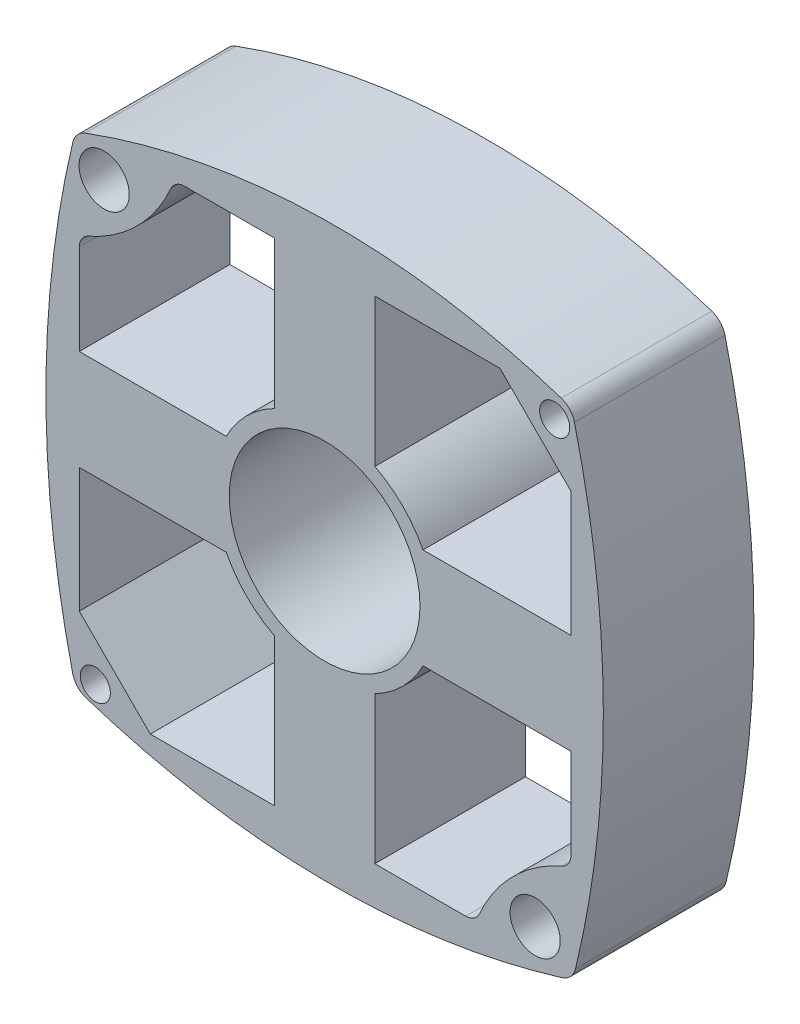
ISO-10303-21;
HEADER;
FILE_DESCRIPTION(('STEP AP214'),'2;1');
FILE_NAME('part.step','',(''),(''),'','','');
FILE_SCHEMA(('AUTOMOTIVE_DESIGN { 1 0 10303 214 1 1 1 1 }'));
ENDSEC;
DATA;
#1=APPLICATION_CONTEXT('core data for automotive mechanical design processes');
#2=APPLICATION_PROTOCOL_DEFINITION('international standard','automotive_design',2000,#1);
#3=PRODUCT_CONTEXT('',#1,'mechanical');
#4=PRODUCT('Part','Part','',(#3));
#5=PRODUCT_RELATED_PRODUCT_CATEGORY('part','',(#4));
#6=PRODUCT_DEFINITION_FORMATION('','',#4);
#7=PRODUCT_DEFINITION_CONTEXT('part definition',#1,'design');
#8=PRODUCT_DEFINITION('design','',#6,#7);
#9=PRODUCT_DEFINITION_SHAPE('','',#8);
#10=(LENGTH_UNIT() NAMED_UNIT(*) SI_UNIT(.MILLI.,.METRE.));
#11=(NAMED_UNIT(*) PLANE_ANGLE_UNIT() SI_UNIT($,.RADIAN.));
#12=(NAMED_UNIT(*) SI_UNIT($,.STERADIAN.) SOLID_ANGLE_UNIT());
#13=UNCERTAINTY_MEASURE_WITH_UNIT(LENGTH_MEASURE(1.E-05),#10,'distance_accuracy_value','');
#14=(GEOMETRIC_REPRESENTATION_CONTEXT(3) GLOBAL_UNCERTAINTY_ASSIGNED_CONTEXT((#13)) GLOBAL_UNIT_ASSIGNED_CONTEXT((#10,
#11,#12)) REPRESENTATION_CONTEXT('',''));
#15=CARTESIAN_POINT('',(0.,0.,0.));
#16=DIRECTION('',(0.,0.,1.));
#17=DIRECTION('',(1.,0.,0.));
#18=AXIS2_PLACEMENT_3D('',#15,#16,#17);
#19=CARTESIAN_POINT('',(24.5333983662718,17.4326752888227,15.));
#20=DIRECTION('',(-1.,0.,0.));
#21=DIRECTION('',(0.,-1.,0.));
#22=AXIS2_PLACEMENT_3D('',#19,#20,#21);
#23=PLANE('',#22);
#24=DIRECTION('',(0.,1.,0.));
#25=VECTOR('',#24,1.);
#26=CARTESIAN_POINT('',(24.5333983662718,17.4326752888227,15.));
#27=LINE('',#26,#25);
#28=CARTESIAN_POINT('',(24.5333983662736,-13.9776558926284,15.));
#29=VERTEX_POINT('',#28);
#30=CARTESIAN_POINT('',(24.5333983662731,-4.93740820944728,15.));
#31=VERTEX_POINT('',#30);
#32=EDGE_CURVE('E765',#29,#31,#27,.T.);
#33=ORIENTED_EDGE('',*,*,#32,.T.);
#34=DIRECTION('',(0.,0.,-1.));
#35=VECTOR('',#34,1.);
#36=CARTESIAN_POINT('',(24.5333983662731,-4.93740820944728,15.));
#37=LINE('',#36,#35);
#38=CARTESIAN_POINT('',(24.5333983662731,-4.93740820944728,0.));
#39=VERTEX_POINT('',#38);
#40=EDGE_CURVE('E11',#31,#39,#37,.T.);
#41=ORIENTED_EDGE('',*,*,#40,.T.);
#42=DIRECTION('',(0.,1.,0.));
#43=VECTOR('',#42,1.);
#44=CARTESIAN_POINT('',(24.5333983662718,17.4326752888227,0.));
#45=LINE('',#44,#43);
#46=CARTESIAN_POINT('',(24.5333983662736,-13.9776558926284,0.));
#47=VERTEX_POINT('',#46);
#48=EDGE_CURVE('E738',#47,#39,#45,.T.);
#49=ORIENTED_EDGE('',*,*,#48,.F.);
#50=DIRECTION('',(0.,0.,1.));
#51=VECTOR('',#50,1.);
#52=CARTESIAN_POINT('',(24.5333983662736,-13.9776558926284,15.));
#53=LINE('',#52,#51);
#54=EDGE_CURVE('E879',#47,#29,#53,.T.);
#55=ORIENTED_EDGE('',*,*,#54,.T.);
#56=EDGE_LOOP('',(#33,#41,#49,#55));
#57=FACE_BOUND('',#56,.T.);
#58=ADVANCED_FACE('F348',(#57),#23,.T.);
#59=CARTESIAN_POINT('',(24.5333983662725,4.93740820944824,0.));
#60=VERTEX_POINT('',#59);
#61=CARTESIAN_POINT('',(24.5333983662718,17.4326752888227,0.));
#62=VERTEX_POINT('',#61);
#63=EDGE_CURVE('E737',#60,#62,#45,.T.);
#64=ORIENTED_EDGE('',*,*,#63,.F.);
#65=DIRECTION('',(0.,0.,-1.));
#66=VECTOR('',#65,1.);
#67=CARTESIAN_POINT('',(24.5333983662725,4.93740820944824,15.));
#68=LINE('',#67,#66);
#69=CARTESIAN_POINT('',(24.5333983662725,4.93740820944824,15.));
#70=VERTEX_POINT('',#69);
#71=EDGE_CURVE('E356',#60,#70,#68,.F.);
#72=ORIENTED_EDGE('',*,*,#71,.T.);
#73=CARTESIAN_POINT('',(24.5333983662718,17.4326752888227,15.));
#74=VERTEX_POINT('',#73);
#75=EDGE_CURVE('E764',#70,#74,#27,.T.);
#76=ORIENTED_EDGE('',*,*,#75,.T.);
#77=DIRECTION('',(0.,0.,-1.));
#78=VECTOR('',#77,1.);
#79=CARTESIAN_POINT('',(24.5333983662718,17.4326752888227,15.));
#80=LINE('',#79,#78);
#81=EDGE_CURVE('E786',#74,#62,#80,.T.);
#82=ORIENTED_EDGE('',*,*,#81,.T.);
#83=EDGE_LOOP('',(#64,#72,#76,#82));
#84=FACE_BOUND('',#83,.T.);
#85=ADVANCED_FACE('F897',(#84),#23,.T.);
#86=CARTESIAN_POINT('',(-24.436295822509,15.0298698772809,15.));
#87=DIRECTION('',(1.,0.,0.));
#88=DIRECTION('',(0.,1.,0.));
#89=AXIS2_PLACEMENT_3D('',#86,#87,#88);
#90=PLANE('',#89);
#91=DIRECTION('',(0.,-1.,0.));
#92=VECTOR('',#91,1.);
#93=CARTESIAN_POINT('',(-24.436295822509,15.0298698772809,15.));
#94=LINE('',#93,#92);
#95=CARTESIAN_POINT('',(-24.4362958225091,14.0186709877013,15.));
#96=VERTEX_POINT('',#95);
#97=CARTESIAN_POINT('',(-24.4362958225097,5.00000000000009,15.));
#98=VERTEX_POINT('',#97);
#99=EDGE_CURVE('E778',#96,#98,#94,.T.);
#100=ORIENTED_EDGE('',*,*,#99,.T.);
#101=DIRECTION('',(0.,0.,-1.));
#102=VECTOR('',#101,1.);
#103=CARTESIAN_POINT('',(-24.4362958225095,5.00000000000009,15.));
#104=LINE('',#103,#102);
#105=CARTESIAN_POINT('',(-24.4362958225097,5.00000000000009,0.));
#106=VERTEX_POINT('',#105);
#107=EDGE_CURVE('E652',#98,#106,#104,.T.);
#108=ORIENTED_EDGE('',*,*,#107,.T.);
#109=DIRECTION('',(0.,-1.,0.));
#110=VECTOR('',#109,1.);
#111=CARTESIAN_POINT('',(-24.436295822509,15.0298698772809,0.));
#112=LINE('',#111,#110);
#113=CARTESIAN_POINT('',(-24.4362958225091,14.0186709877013,0.));
#114=VERTEX_POINT('',#113);
#115=EDGE_CURVE('E752',#114,#106,#112,.T.);
#116=ORIENTED_EDGE('',*,*,#115,.F.);
#117=DIRECTION('',(0.,0.,1.));
#118=VECTOR('',#117,1.);
#119=CARTESIAN_POINT('',(-24.4362958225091,14.0186709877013,15.));
#120=LINE('',#119,#118);
#121=EDGE_CURVE('E857',#114,#96,#120,.T.);
#122=ORIENTED_EDGE('',*,*,#121,.T.);
#123=EDGE_LOOP('',(#100,#108,#116,#122));
#124=FACE_BOUND('',#123,.T.);
#125=ADVANCED_FACE('F939',(#124),#90,.T.);
#126=CARTESIAN_POINT('',(-24.43629582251,-4.99999999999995,0.));
#127=VERTEX_POINT('',#126);
#128=CARTESIAN_POINT('',(-24.4362958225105,-17.3999490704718,0.));
#129=VERTEX_POINT('',#128);
#130=EDGE_CURVE('E751',#127,#129,#112,.T.);
#131=ORIENTED_EDGE('',*,*,#130,.F.);
#132=DIRECTION('',(0.,0.,1.));
#133=VECTOR('',#132,1.);
#134=CARTESIAN_POINT('',(-24.43629582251,-4.99999999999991,15.));
#135=LINE('',#134,#133);
#136=CARTESIAN_POINT('',(-24.4362958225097,-4.99999999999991,15.));
#137=VERTEX_POINT('',#136);
#138=EDGE_CURVE('E607',#127,#137,#135,.T.);
#139=ORIENTED_EDGE('',*,*,#138,.T.);
#140=CARTESIAN_POINT('',(-24.4362958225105,-17.3999490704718,15.));
#141=VERTEX_POINT('',#140);
#142=EDGE_CURVE('E777',#137,#141,#94,.T.);
#143=ORIENTED_EDGE('',*,*,#142,.T.);
#144=DIRECTION('',(0.,0.,-1.));
#145=VECTOR('',#144,1.);
#146=CARTESIAN_POINT('',(-24.4362958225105,-17.3999490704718,15.));
#147=LINE('',#146,#145);
#148=EDGE_CURVE('E781',#141,#129,#147,.T.);
#149=ORIENTED_EDGE('',*,*,#148,.T.);
#150=EDGE_LOOP('',(#131,#139,#143,#149));
#151=FACE_BOUND('',#150,.T.);
#152=ADVANCED_FACE('F1068',(#151),#90,.T.);
#153=CARTESIAN_POINT('',(0.,0.,15.));
#154=DIRECTION('',(0.,0.,-1.));
#155=DIRECTION('',(-1.,0.,0.));
#156=AXIS2_PLACEMENT_3D('',#153,#154,#155);
#157=CYLINDRICAL_SURFACE('',#156,11.);
#158=DIRECTION('',(0.,0.,-1.));
#159=VECTOR('',#158,1.);
#160=CARTESIAN_POINT('',(-9.79795897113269,5.00000000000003,15.));
#161=LINE('',#160,#159);
#162=CARTESIAN_POINT('',(-9.79795897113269,5.00000000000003,15.));
#163=VERTEX_POINT('',#162);
#164=CARTESIAN_POINT('',(-9.79795897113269,5.00000000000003,0.));
#165=VERTEX_POINT('',#164);
#166=EDGE_CURVE('E646',#163,#165,#161,.T.);
#167=ORIENTED_EDGE('',*,*,#166,.F.);
#168=CARTESIAN_POINT('',(0.,0.,15.));
#169=DIRECTION('',(0.,0.,1.));
#170=DIRECTION('',(1.,0.,0.));
#171=AXIS2_PLACEMENT_3D('',#168,#169,#170);
#172=CIRCLE('',#171,11.);
#173=CARTESIAN_POINT('',(-5.,9.79795897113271,15.));
#174=VERTEX_POINT('',#173);
#175=EDGE_CURVE('E671',#174,#163,#172,.T.);
#176=ORIENTED_EDGE('',*,*,#175,.F.);
#177=DIRECTION('',(0.,0.,-1.));
#178=VECTOR('',#177,1.);
#179=CARTESIAN_POINT('',(-5.,9.79795897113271,15.));
#180=LINE('',#179,#178);
#181=CARTESIAN_POINT('',(-5.,9.79795897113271,0.));
#182=VERTEX_POINT('',#181);
#183=EDGE_CURVE('E697',#174,#182,#180,.T.);
#184=ORIENTED_EDGE('',*,*,#183,.T.);
#185=CARTESIAN_POINT('',(0.,0.,0.));
#186=DIRECTION('',(0.,0.,1.));
#187=DIRECTION('',(1.,0.,0.));
#188=AXIS2_PLACEMENT_3D('',#185,#186,#187);
#189=CIRCLE('',#188,11.);
#190=EDGE_CURVE('E658',#182,#165,#189,.T.);
#191=ORIENTED_EDGE('',*,*,#190,.T.);
#192=EDGE_LOOP('',(#167,#176,#184,#191));
#193=FACE_BOUND('',#192,.T.);
#194=ADVANCED_FACE('F928',(#193),#157,.T.);
#195=DIRECTION('',(0.,0.,-1.));
#196=VECTOR('',#195,1.);
#197=CARTESIAN_POINT('',(-9.79795897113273,-4.99999999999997,15.));
#198=LINE('',#197,#196);
#199=CARTESIAN_POINT('',(-9.79795897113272,-4.99999999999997,15.));
#200=VERTEX_POINT('',#199);
#201=CARTESIAN_POINT('',(-9.79795897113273,-4.99999999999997,0.));
#202=VERTEX_POINT('',#201);
#203=EDGE_CURVE('E643',#200,#202,#198,.T.);
#204=ORIENTED_EDGE('',*,*,#203,.T.);
#205=CARTESIAN_POINT('',(-5.,-9.79795897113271,0.));
#206=VERTEX_POINT('',#205);
#207=EDGE_CURVE('E657',#202,#206,#189,.T.);
#208=ORIENTED_EDGE('',*,*,#207,.T.);
#209=DIRECTION('',(0.,0.,-1.));
#210=VECTOR('',#209,1.);
#211=CARTESIAN_POINT('',(-5.,-9.79795897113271,15.));
#212=LINE('',#211,#210);
#213=CARTESIAN_POINT('',(-5.,-9.79795897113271,15.));
#214=VERTEX_POINT('',#213);
#215=EDGE_CURVE('E694',#214,#206,#212,.T.);
#216=ORIENTED_EDGE('',*,*,#215,.F.);
#217=EDGE_CURVE('E670',#200,#214,#172,.T.);
#218=ORIENTED_EDGE('',*,*,#217,.F.);
#219=EDGE_LOOP('',(#204,#208,#216,#218));
#220=FACE_BOUND('',#219,.T.);
#221=ADVANCED_FACE('F920',(#220),#157,.T.);
#222=CARTESIAN_POINT('',(0.,0.,15.));
#223=DIRECTION('',(0.,0.,-1.));
#224=DIRECTION('',(-1.,0.,0.));
#225=AXIS2_PLACEMENT_3D('',#222,#223,#224);
#226=CYLINDRICAL_SURFACE('',#225,11.);
#227=DIRECTION('',(0.,0.,-1.));
#228=VECTOR('',#227,1.);
#229=CARTESIAN_POINT('',(9.79795897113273,4.99999999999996,15.));
#230=LINE('',#229,#228);
#231=CARTESIAN_POINT('',(9.79795897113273,4.99999999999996,15.));
#232=VERTEX_POINT('',#231);
#233=CARTESIAN_POINT('',(9.79795897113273,4.99999999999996,0.));
#234=VERTEX_POINT('',#233);
#235=EDGE_CURVE('E608',#232,#234,#230,.T.);
#236=ORIENTED_EDGE('',*,*,#235,.T.);
#237=CARTESIAN_POINT('',(0.,0.,0.));
#238=DIRECTION('',(0.,0.,1.));
#239=DIRECTION('',(1.,0.,0.));
#240=AXIS2_PLACEMENT_3D('',#237,#238,#239);
#241=CIRCLE('',#240,11.);
#242=CARTESIAN_POINT('',(5.,9.79795897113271,0.));
#243=VERTEX_POINT('',#242);
#244=EDGE_CURVE('E613',#234,#243,#241,.T.);
#245=ORIENTED_EDGE('',*,*,#244,.T.);
#246=DIRECTION('',(0.,0.,-1.));
#247=VECTOR('',#246,1.);
#248=CARTESIAN_POINT('',(5.,9.79795897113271,15.));
#249=LINE('',#248,#247);
#250=CARTESIAN_POINT('',(5.,9.79795897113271,15.));
#251=VERTEX_POINT('',#250);
#252=EDGE_CURVE('E688',#251,#243,#249,.T.);
#253=ORIENTED_EDGE('',*,*,#252,.F.);
#254=CARTESIAN_POINT('',(0.,0.,15.));
#255=DIRECTION('',(0.,0.,1.));
#256=DIRECTION('',(1.,0.,0.));
#257=AXIS2_PLACEMENT_3D('',#254,#255,#256);
#258=CIRCLE('',#257,11.);
#259=EDGE_CURVE('E679',#232,#251,#258,.T.);
#260=ORIENTED_EDGE('',*,*,#259,.F.);
#261=EDGE_LOOP('',(#236,#245,#253,#260));
#262=FACE_BOUND('',#261,.T.);
#263=ADVANCED_FACE('F917',(#262),#226,.T.);
#264=DIRECTION('',(0.,0.,-1.));
#265=VECTOR('',#264,1.);
#266=CARTESIAN_POINT('',(9.7979589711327,-5.00000000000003,15.));
#267=LINE('',#266,#265);
#268=CARTESIAN_POINT('',(9.79795897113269,-5.00000000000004,15.));
#269=VERTEX_POINT('',#268);
#270=CARTESIAN_POINT('',(9.79795897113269,-5.00000000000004,0.));
#271=VERTEX_POINT('',#270);
#272=EDGE_CURVE('E640',#269,#271,#267,.T.);
#273=ORIENTED_EDGE('',*,*,#272,.F.);
#274=CARTESIAN_POINT('',(5.00000000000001,-9.79795897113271,15.));
#275=VERTEX_POINT('',#274);
#276=EDGE_CURVE('E680',#275,#269,#258,.T.);
#277=ORIENTED_EDGE('',*,*,#276,.F.);
#278=DIRECTION('',(0.,0.,-1.));
#279=VECTOR('',#278,1.);
#280=CARTESIAN_POINT('',(5.00000000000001,-9.79795897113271,15.));
#281=LINE('',#280,#279);
#282=CARTESIAN_POINT('',(5.00000000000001,-9.79795897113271,0.));
#283=VERTEX_POINT('',#282);
#284=EDGE_CURVE('E691',#275,#283,#281,.T.);
#285=ORIENTED_EDGE('',*,*,#284,.T.);
#286=EDGE_CURVE('E664',#283,#271,#241,.T.);
#287=ORIENTED_EDGE('',*,*,#286,.T.);
#288=EDGE_LOOP('',(#273,#277,#285,#287));
#289=FACE_BOUND('',#288,.T.);
#290=ADVANCED_FACE('F919',(#289),#226,.T.);
#291=CARTESIAN_POINT('',(-17.3677609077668,-24.468483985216,15.));
#292=DIRECTION('',(0.,1.,0.));
#293=DIRECTION('',(-1.,0.,0.));
#294=AXIS2_PLACEMENT_3D('',#291,#292,#293);
#295=PLANE('',#294);
#296=DIRECTION('',(1.,0.,0.));
#297=VECTOR('',#296,1.);
#298=CARTESIAN_POINT('',(-17.3677609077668,-24.468483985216,15.));
#299=LINE('',#298,#297);
#300=CARTESIAN_POINT('',(-17.3677609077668,-24.468483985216,15.));
#301=VERTEX_POINT('',#300);
#302=CARTESIAN_POINT('',(-5.,-24.4684839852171,15.));
#303=VERTEX_POINT('',#302);
#304=EDGE_CURVE('E758',#301,#303,#299,.T.);
#305=ORIENTED_EDGE('',*,*,#304,.T.);
#306=DIRECTION('',(0.,0.,-1.));
#307=VECTOR('',#306,1.);
#308=CARTESIAN_POINT('',(-5.,-24.4684839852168,15.));
#309=LINE('',#308,#307);
#310=CARTESIAN_POINT('',(-5.,-24.4684839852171,0.));
#311=VERTEX_POINT('',#310);
#312=EDGE_CURVE('E893',#303,#311,#309,.T.);
#313=ORIENTED_EDGE('',*,*,#312,.T.);
#314=DIRECTION('',(1.,0.,0.));
#315=VECTOR('',#314,1.);
#316=CARTESIAN_POINT('',(-17.3677609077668,-24.468483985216,0.));
#317=LINE('',#316,#315);
#318=CARTESIAN_POINT('',(-17.3677609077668,-24.468483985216,0.));
#319=VERTEX_POINT('',#318);
#320=EDGE_CURVE('E731',#319,#311,#317,.T.);
#321=ORIENTED_EDGE('',*,*,#320,.F.);
#322=DIRECTION('',(0.,0.,-1.));
#323=VECTOR('',#322,1.);
#324=CARTESIAN_POINT('',(-17.3677609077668,-24.468483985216,15.));
#325=LINE('',#324,#323);
#326=EDGE_CURVE('E789',#301,#319,#325,.T.);
#327=ORIENTED_EDGE('',*,*,#326,.F.);
#328=EDGE_LOOP('',(#305,#313,#321,#327));
#329=FACE_BOUND('',#328,.T.);
#330=ADVANCED_FACE('F926',(#329),#295,.T.);
#331=CARTESIAN_POINT('',(5.,-24.4684839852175,0.));
#332=VERTEX_POINT('',#331);
#333=CARTESIAN_POINT('',(14.0508591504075,-24.4684839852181,0.));
#334=VERTEX_POINT('',#333);
#335=EDGE_CURVE('E730',#332,#334,#317,.T.);
#336=ORIENTED_EDGE('',*,*,#335,.F.);
#337=DIRECTION('',(0.,0.,1.));
#338=VECTOR('',#337,1.);
#339=CARTESIAN_POINT('',(5.,-24.4684839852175,15.));
#340=LINE('',#339,#338);
#341=CARTESIAN_POINT('',(5.,-24.4684839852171,15.));
#342=VERTEX_POINT('',#341);
#343=EDGE_CURVE('E890',#332,#342,#340,.T.);
#344=ORIENTED_EDGE('',*,*,#343,.T.);
#345=CARTESIAN_POINT('',(14.0508591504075,-24.4684839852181,15.));
#346=VERTEX_POINT('',#345);
#347=EDGE_CURVE('E757',#342,#346,#299,.T.);
#348=ORIENTED_EDGE('',*,*,#347,.T.);
#349=DIRECTION('',(0.,0.,1.));
#350=VECTOR('',#349,1.);
#351=CARTESIAN_POINT('',(14.0508591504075,-24.4684839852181,0.));
#352=LINE('',#351,#350);
#353=EDGE_CURVE('E871',#346,#334,#352,.F.);
#354=ORIENTED_EDGE('',*,*,#353,.T.);
#355=EDGE_LOOP('',(#336,#344,#348,#354));
#356=FACE_BOUND('',#355,.T.);
#357=ADVANCED_FACE('F950',(#356),#295,.T.);
#358=CARTESIAN_POINT('',(-14.9556277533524,24.5012102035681,15.));
#359=DIRECTION('',(0.,-1.,0.));
#360=DIRECTION('',(1.,0.,0.));
#361=AXIS2_PLACEMENT_3D('',#358,#359,#360);
#362=PLANE('',#361);
#363=DIRECTION('',(-1.,0.,0.));
#364=VECTOR('',#363,1.);
#365=CARTESIAN_POINT('',(-14.9556277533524,24.5012102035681,0.));
#366=LINE('',#365,#364);
#367=CARTESIAN_POINT('',(-4.99999999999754,24.5012102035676,0.));
#368=VERTEX_POINT('',#367);
#369=CARTESIAN_POINT('',(-13.94546772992,24.5012102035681,0.));
#370=VERTEX_POINT('',#369);
#371=EDGE_CURVE('E744',#368,#370,#366,.T.);
#372=ORIENTED_EDGE('',*,*,#371,.F.);
#373=DIRECTION('',(0.,0.,-1.));
#374=VECTOR('',#373,1.);
#375=CARTESIAN_POINT('',(-5.,24.5012102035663,15.));
#376=LINE('',#375,#374);
#377=CARTESIAN_POINT('',(-5.,24.5012102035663,15.));
#378=VERTEX_POINT('',#377);
#379=EDGE_CURVE('E700',#378,#368,#376,.T.);
#380=ORIENTED_EDGE('',*,*,#379,.F.);
#381=DIRECTION('',(-1.,0.,0.));
#382=VECTOR('',#381,1.);
#383=CARTESIAN_POINT('',(-14.9556277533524,24.5012102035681,15.));
#384=LINE('',#383,#382);
#385=CARTESIAN_POINT('',(-13.94546772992,24.5012102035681,15.));
#386=VERTEX_POINT('',#385);
#387=EDGE_CURVE('E770',#378,#386,#384,.T.);
#388=ORIENTED_EDGE('',*,*,#387,.T.);
#389=DIRECTION('',(0.,0.,1.));
#390=VECTOR('',#389,1.);
#391=CARTESIAN_POINT('',(-13.94546772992,24.5012102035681,0.));
#392=LINE('',#391,#390);
#393=EDGE_CURVE('E859',#386,#370,#392,.F.);
#394=ORIENTED_EDGE('',*,*,#393,.T.);
#395=EDGE_LOOP('',(#372,#380,#388,#394));
#396=FACE_BOUND('',#395,.T.);
#397=ADVANCED_FACE('F1072',(#396),#362,.T.);
#398=CARTESIAN_POINT('',(17.4648634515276,24.5012102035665,15.));
#399=VERTEX_POINT('',#398);
#400=CARTESIAN_POINT('',(5.,24.5012102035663,15.));
#401=VERTEX_POINT('',#400);
#402=EDGE_CURVE('E771',#399,#401,#384,.T.);
#403=ORIENTED_EDGE('',*,*,#402,.T.);
#404=DIRECTION('',(0.,0.,-1.));
#405=VECTOR('',#404,1.);
#406=CARTESIAN_POINT('',(5.,24.5012102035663,15.));
#407=LINE('',#406,#405);
#408=CARTESIAN_POINT('',(5.,24.5012102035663,0.));
#409=VERTEX_POINT('',#408);
#410=EDGE_CURVE('E685',#401,#409,#407,.T.);
#411=ORIENTED_EDGE('',*,*,#410,.T.);
#412=CARTESIAN_POINT('',(17.4648634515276,24.5012102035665,0.));
#413=VERTEX_POINT('',#412);
#414=EDGE_CURVE('E745',#413,#409,#366,.T.);
#415=ORIENTED_EDGE('',*,*,#414,.F.);
#416=DIRECTION('',(0.,0.,-1.));
#417=VECTOR('',#416,1.);
#418=CARTESIAN_POINT('',(17.4648634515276,24.5012102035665,15.));
#419=LINE('',#418,#417);
#420=EDGE_CURVE('E784',#399,#413,#419,.T.);
#421=ORIENTED_EDGE('',*,*,#420,.F.);
#422=EDGE_LOOP('',(#403,#411,#415,#421));
#423=FACE_BOUND('',#422,.T.);
#424=ADVANCED_FACE('F910',(#423),#362,.T.);
#425=CARTESIAN_POINT('',(36.4242579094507,-21.7661300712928,15.));
#426=DIRECTION('',(0.,0.,-1.));
#427=DIRECTION('',(-1.,0.,0.));
#428=AXIS2_PLACEMENT_3D('',#425,#426,#427);
#429=PLANE('',#428);
#430=CARTESIAN_POINT('',(0.,0.,15.));
#431=DIRECTION('',(0.,0.,1.));
#432=DIRECTION('',(1.,0.,0.));
#433=AXIS2_PLACEMENT_3D('',#430,#431,#432);
#434=CIRCLE('',#433,9.5);
#435=CARTESIAN_POINT('',(9.5,0.,15.));
#436=VERTEX_POINT('',#435);
#437=EDGE_CURVE('E1147',#436,#436,#434,.T.);
#438=ORIENTED_EDGE('',*,*,#437,.F.);
#439=EDGE_LOOP('',(#438));
#440=FACE_BOUND('',#439,.T.);
#441=ORIENTED_EDGE('',*,*,#75,.F.);
#442=CARTESIAN_POINT('',(15.0076892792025,0.0783337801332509,15.));
#443=DIRECTION('',(0.,0.,1.));
#444=DIRECTION('',(0.,1.,0.));
#445=AXIS2_PLACEMENT_3D('',#442,#443,#444);
#446=CIRCLE('',#445,10.6934436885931);
#447=CARTESIAN_POINT('',(24.5012102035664,4.99999999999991,15.));
#448=VERTEX_POINT('',#447);
#449=EDGE_CURVE('E626',#70,#448,#446,.T.);
#450=ORIENTED_EDGE('',*,*,#449,.T.);
#451=DIRECTION('',(-1.,0.,0.));
#452=VECTOR('',#451,1.);
#453=CARTESIAN_POINT('',(24.5012102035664,4.99999999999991,15.));
#454=LINE('',#453,#452);
#455=EDGE_CURVE('E606',#448,#232,#454,.T.);
#456=ORIENTED_EDGE('',*,*,#455,.T.);
#457=ORIENTED_EDGE('',*,*,#259,.T.);
#458=DIRECTION('',(0.,1.,0.));
#459=VECTOR('',#458,1.);
#460=CARTESIAN_POINT('',(5.,24.5012102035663,15.));
#461=LINE('',#460,#459);
#462=EDGE_CURVE('E683',#251,#401,#461,.T.);
#463=ORIENTED_EDGE('',*,*,#462,.T.);
#464=ORIENTED_EDGE('',*,*,#402,.F.);
#465=DIRECTION('',(-0.707106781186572,0.707106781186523,0.));
#466=VECTOR('',#465,1.);
#467=CARTESIAN_POINT('',(17.4648634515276,24.5012102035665,15.));
#468=LINE('',#467,#466);
#469=EDGE_CURVE('E768',#74,#399,#468,.T.);
#470=ORIENTED_EDGE('',*,*,#469,.F.);
#471=EDGE_LOOP('',(#441,#450,#456,#457,#463,#464,#470));
#472=FACE_BOUND('',#471,.T.);
#473=DIRECTION('',(0.,-1.,0.));
#474=VECTOR('',#473,1.);
#475=CARTESIAN_POINT('',(-5.,24.5012102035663,15.));
#476=LINE('',#475,#474);
#477=EDGE_CURVE('E668',#378,#174,#476,.T.);
#478=ORIENTED_EDGE('',*,*,#477,.T.);
#479=ORIENTED_EDGE('',*,*,#175,.T.);
#480=DIRECTION('',(-1.,0.,0.));
#481=VECTOR('',#480,1.);
#482=CARTESIAN_POINT('',(-24.5012102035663,5.00000000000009,15.));
#483=LINE('',#482,#481);
#484=EDGE_CURVE('E629',#163,#98,#483,.T.);
#485=ORIENTED_EDGE('',*,*,#484,.T.);
#486=ORIENTED_EDGE('',*,*,#99,.F.);
#487=CARTESIAN_POINT('',(-22.9362958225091,14.0186709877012,15.));
#488=DIRECTION('',(0.,0.,-1.));
#489=DIRECTION('',(-1.,0.,0.));
#490=AXIS2_PLACEMENT_3D('',#487,#488,#489);
#491=CIRCLE('',#490,1.5);
#492=CARTESIAN_POINT('',(-23.5396822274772,15.3919607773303,15.));
#493=VERTEX_POINT('',#492);
#494=EDGE_CURVE('E864',#96,#493,#491,.T.);
#495=ORIENTED_EDGE('',*,*,#494,.T.);
#496=CARTESIAN_POINT('',(-29.9876635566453,30.0673774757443,15.));
#497=DIRECTION('',(0.,0.,-1.));
#498=DIRECTION('',(-1.,0.,0.));
#499=AXIS2_PLACEMENT_3D('',#496,#497,#498);
#500=CIRCLE('',#499,16.0294827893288);
#501=CARTESIAN_POINT('',(-15.3182004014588,23.605863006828,15.));
#502=VERTEX_POINT('',#501);
#503=EDGE_CURVE('E774',#502,#493,#500,.T.);
#504=ORIENTED_EDGE('',*,*,#503,.F.);
#505=CARTESIAN_POINT('',(-13.9454677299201,23.0012102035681,15.));
#506=DIRECTION('',(0.,0.,-1.));
#507=DIRECTION('',(-1.,0.,0.));
#508=AXIS2_PLACEMENT_3D('',#505,#506,#507);
#509=CIRCLE('',#508,1.5);
#510=EDGE_CURVE('E868',#502,#386,#509,.T.);
#511=ORIENTED_EDGE('',*,*,#510,.T.);
#512=ORIENTED_EDGE('',*,*,#387,.F.);
#513=EDGE_LOOP('',(#478,#479,#485,#486,#495,#504,#511,#512));
#514=FACE_BOUND('',#513,.T.);
#515=ORIENTED_EDGE('',*,*,#142,.F.);
#516=DIRECTION('',(1.,0.,0.));
#517=VECTOR('',#516,1.);
#518=CARTESIAN_POINT('',(-24.5012102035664,-4.99999999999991,15.));
#519=LINE('',#518,#517);
#520=EDGE_CURVE('E632',#137,#200,#519,.T.);
#521=ORIENTED_EDGE('',*,*,#520,.T.);
#522=ORIENTED_EDGE('',*,*,#217,.T.);
#523=DIRECTION('',(0.,-1.,0.));
#524=VECTOR('',#523,1.);
#525=CARTESIAN_POINT('',(-5.,-24.5012102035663,15.));
#526=LINE('',#525,#524);
#527=EDGE_CURVE('E674',#214,#303,#526,.T.);
#528=ORIENTED_EDGE('',*,*,#527,.T.);
#529=ORIENTED_EDGE('',*,*,#304,.F.);
#530=DIRECTION('',(0.707106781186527,-0.707106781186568,0.));
#531=VECTOR('',#530,1.);
#532=CARTESIAN_POINT('',(-24.4362958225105,-17.3999490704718,15.));
#533=LINE('',#532,#531);
#534=EDGE_CURVE('E755',#141,#301,#533,.T.);
#535=ORIENTED_EDGE('',*,*,#534,.F.);
#536=EDGE_LOOP('',(#515,#521,#522,#528,#529,#535));
#537=FACE_BOUND('',#536,.T.);
#538=CARTESIAN_POINT('',(15.0076892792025,-0.0783337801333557,15.));
#539=DIRECTION('',(0.,0.,1.));
#540=DIRECTION('',(0.,-1.,0.));
#541=AXIS2_PLACEMENT_3D('',#538,#539,#540);
#542=CIRCLE('',#541,10.6934436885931);
#543=CARTESIAN_POINT('',(24.5012102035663,-5.00000000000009,15.));
#544=VERTEX_POINT('',#543);
#545=EDGE_CURVE('E623',#544,#31,#542,.T.);
#546=ORIENTED_EDGE('',*,*,#545,.T.);
#547=ORIENTED_EDGE('',*,*,#32,.F.);
#548=CARTESIAN_POINT('',(23.0333983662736,-13.9776558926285,15.));
#549=DIRECTION('',(0.,0.,-1.));
#550=DIRECTION('',(-1.,0.,0.));
#551=AXIS2_PLACEMENT_3D('',#548,#549,#550);
#552=CIRCLE('',#551,1.5);
#553=CARTESIAN_POINT('',(23.6380511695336,-15.3503885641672,15.));
#554=VERTEX_POINT('',#553);
#555=EDGE_CURVE('E888',#29,#554,#552,.T.);
#556=ORIENTED_EDGE('',*,*,#555,.T.);
#557=CARTESIAN_POINT('',(30.0995656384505,-30.0198517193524,15.));
#558=DIRECTION('',(0.,0.,-1.));
#559=DIRECTION('',(1.,0.,0.));
#560=AXIS2_PLACEMENT_3D('',#557,#558,#559);
#561=CIRCLE('',#560,16.0294827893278);
#562=CARTESIAN_POINT('',(15.4241489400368,-23.5718703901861,15.));
#563=VERTEX_POINT('',#562);
#564=EDGE_CURVE('E761',#563,#554,#561,.T.);
#565=ORIENTED_EDGE('',*,*,#564,.F.);
#566=CARTESIAN_POINT('',(14.0508591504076,-22.9684839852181,15.));
#567=DIRECTION('',(0.,0.,-1.));
#568=DIRECTION('',(-1.,0.,0.));
#569=AXIS2_PLACEMENT_3D('',#566,#567,#568);
#570=CIRCLE('',#569,1.5);
#571=EDGE_CURVE('E883',#563,#346,#570,.T.);
#572=ORIENTED_EDGE('',*,*,#571,.T.);
#573=ORIENTED_EDGE('',*,*,#347,.F.);
#574=DIRECTION('',(0.,1.,0.));
#575=VECTOR('',#574,1.);
#576=CARTESIAN_POINT('',(5.,-24.5012102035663,15.));
#577=LINE('',#576,#575);
#578=EDGE_CURVE('E677',#342,#275,#577,.T.);
#579=ORIENTED_EDGE('',*,*,#578,.T.);
#580=ORIENTED_EDGE('',*,*,#276,.T.);
#581=DIRECTION('',(1.,0.,0.));
#582=VECTOR('',#581,1.);
#583=CARTESIAN_POINT('',(24.5012102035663,-5.00000000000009,15.));
#584=LINE('',#583,#582);
#585=EDGE_CURVE('E635',#269,#544,#584,.T.);
#586=ORIENTED_EDGE('',*,*,#585,.T.);
#587=EDGE_LOOP('',(#546,#547,#556,#565,#572,#573,#579,#580,#586));
#588=FACE_BOUND('',#587,.T.);
#589=CARTESIAN_POINT('',(1.06898181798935,-43.317450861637,15.));
#590=DIRECTION('',(0.,0.,1.));
#591=DIRECTION('',(1.,0.,0.));
#592=AXIS2_PLACEMENT_3D('',#589,#590,#591);
#593=CIRCLE('',#592,71.9064972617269);
#594=CARTESIAN_POINT('',(23.5660183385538,24.9791646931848,15.));
#595=VERTEX_POINT('',#594);
#596=CARTESIAN_POINT('',(-23.8295613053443,24.1407354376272,15.));
#597=VERTEX_POINT('',#596);
#598=EDGE_CURVE('E811',#595,#597,#593,.T.);
#599=ORIENTED_EDGE('',*,*,#598,.T.);
#600=CARTESIAN_POINT('',(-23.1370357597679,22.2644603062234,15.));
#601=DIRECTION('',(0.,0.,-1.));
#602=DIRECTION('',(-1.,0.,0.));
#603=AXIS2_PLACEMENT_3D('',#600,#601,#602);
#604=CIRCLE('',#603,2.);
#605=CARTESIAN_POINT('',(-25.0832007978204,22.7253742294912,15.));
#606=VERTEX_POINT('',#605);
#607=EDGE_CURVE('E842',#597,#606,#604,.F.);
#608=ORIENTED_EDGE('',*,*,#607,.T.);
#609=CARTESIAN_POINT('',(71.7795340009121,-0.21480928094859,15.));
#610=DIRECTION('',(0.,0.,1.));
#611=DIRECTION('',(-1.,0.,0.));
#612=AXIS2_PLACEMENT_3D('',#609,#610,#611);
#613=CIRCLE('',#612,99.5421589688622);
#614=CARTESIAN_POINT('',(-25.0947533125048,-23.1061585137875,15.));
#615=VERTEX_POINT('',#614);
#616=EDGE_CURVE('E803',#606,#615,#613,.T.);
#617=ORIENTED_EDGE('',*,*,#616,.T.);
#618=CARTESIAN_POINT('',(-23.14835616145,-22.6462257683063,15.));
#619=DIRECTION('',(0.,0.,-1.));
#620=DIRECTION('',(-1.,0.,0.));
#621=AXIS2_PLACEMENT_3D('',#618,#619,#620);
#622=CIRCLE('',#621,2.);
#623=CARTESIAN_POINT('',(-23.7693524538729,-24.5473737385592,15.));
#624=VERTEX_POINT('',#623);
#625=EDGE_CURVE('E838',#615,#624,#622,.F.);
#626=ORIENTED_EDGE('',*,*,#625,.T.);
#627=CARTESIAN_POINT('',(0.61921748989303,50.1169693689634,15.));
#628=DIRECTION('',(0.,0.,1.));
#629=DIRECTION('',(-1.,0.,0.));
#630=AXIS2_PLACEMENT_3D('',#627,#628,#629);
#631=CIRCLE('',#630,78.5465879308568);
#632=CARTESIAN_POINT('',(23.6331557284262,-24.9824655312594,15.));
#633=VERTEX_POINT('',#632);
#634=EDGE_CURVE('E806',#624,#633,#631,.T.);
#635=ORIENTED_EDGE('',*,*,#634,.T.);
#636=CARTESIAN_POINT('',(23.0471611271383,-23.0702389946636,15.));
#637=DIRECTION('',(0.,0.,-1.));
#638=DIRECTION('',(-1.,0.,0.));
#639=AXIS2_PLACEMENT_3D('',#636,#637,#638);
#640=CIRCLE('',#639,2.);
#641=CARTESIAN_POINT('',(24.9914833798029,-23.5388656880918,15.));
#642=VERTEX_POINT('',#641);
#643=EDGE_CURVE('E840',#633,#642,#640,.F.);
#644=ORIENTED_EDGE('',*,*,#643,.T.);
#645=CARTESIAN_POINT('',(-71.7795340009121,-0.21480928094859,15.));
#646=DIRECTION('',(0.,0.,1.));
#647=DIRECTION('',(1.,0.,0.));
#648=AXIS2_PLACEMENT_3D('',#645,#646,#647);
#649=CIRCLE('',#648,99.5421589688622);
#650=CARTESIAN_POINT('',(24.8824189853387,23.5571964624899,15.));
#651=VERTEX_POINT('',#650);
#652=EDGE_CURVE('E809',#642,#651,#649,.T.);
#653=ORIENTED_EDGE('',*,*,#652,.T.);
#654=CARTESIAN_POINT('',(22.9402880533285,23.079569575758,15.));
#655=DIRECTION('',(0.,0.,-1.));
#656=DIRECTION('',(-1.,0.,0.));
#657=AXIS2_PLACEMENT_3D('',#654,#655,#656);
#658=CIRCLE('',#657,2.);
#659=EDGE_CURVE('E823',#651,#595,#658,.F.);
#660=ORIENTED_EDGE('',*,*,#659,.T.);
#661=EDGE_LOOP('',(#599,#608,#617,#626,#635,#644,#653,#660));
#662=FACE_BOUND('',#661,.T.);
#663=CARTESIAN_POINT('',(-21.9636909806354,21.0273492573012,15.));
#664=DIRECTION('',(0.,0.,1.));
#665=DIRECTION('',(1.,0.,0.));
#666=AXIS2_PLACEMENT_3D('',#663,#664,#665);
#667=CIRCLE('',#666,2.5);
#668=CARTESIAN_POINT('',(-19.4636909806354,21.0273492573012,15.));
#669=VERTEX_POINT('',#668);
#670=EDGE_CURVE('E721',#669,#669,#667,.T.);
#671=ORIENTED_EDGE('',*,*,#670,.F.);
#672=EDGE_LOOP('',(#671));
#673=FACE_BOUND('',#672,.T.);
#674=CARTESIAN_POINT('',(20.9726294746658,-21.9089711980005,15.));
#675=DIRECTION('',(0.,0.,1.));
#676=DIRECTION('',(-1.,0.,0.));
#677=AXIS2_PLACEMENT_3D('',#674,#675,#676);
#678=CIRCLE('',#677,2.5000000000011);
#679=CARTESIAN_POINT('',(18.4726294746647,-21.9089711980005,15.));
#680=VERTEX_POINT('',#679);
#681=EDGE_CURVE('E715',#680,#680,#678,.T.);
#682=ORIENTED_EDGE('',*,*,#681,.F.);
#683=EDGE_LOOP('',(#682));
#684=FACE_BOUND('',#683,.T.);
#685=CARTESIAN_POINT('',(22.9140295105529,22.840101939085,15.));
#686=DIRECTION('',(0.,0.,1.));
#687=DIRECTION('',(1.,0.,0.));
#688=AXIS2_PLACEMENT_3D('',#685,#686,#687);
#689=CIRCLE('',#688,1.5);
#690=CARTESIAN_POINT('',(24.4140295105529,22.840101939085,15.));
#691=VERTEX_POINT('',#690);
#692=EDGE_CURVE('E709',#691,#691,#689,.T.);
#693=ORIENTED_EDGE('',*,*,#692,.F.);
#694=EDGE_LOOP('',(#693));
#695=FACE_BOUND('',#694,.T.);
#696=CARTESIAN_POINT('',(-22.840101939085,-22.9140295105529,15.));
#697=DIRECTION('',(0.,0.,1.));
#698=DIRECTION('',(-1.,0.,0.));
#699=AXIS2_PLACEMENT_3D('',#696,#697,#698);
#700=CIRCLE('',#699,1.5);
#701=CARTESIAN_POINT('',(-24.340101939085,-22.9140295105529,15.));
#702=VERTEX_POINT('',#701);
#703=EDGE_CURVE('E703',#702,#702,#700,.T.);
#704=ORIENTED_EDGE('',*,*,#703,.F.);
#705=EDGE_LOOP('',(#704));
#706=FACE_BOUND('',#705,.T.);
#707=ADVANCED_FACE('F901',(#440,#472,#514,#537,#588,#662,#673,#684,#695,#706),#429,.F.);
#708=CARTESIAN_POINT('',(36.4242579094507,-21.7661300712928,0.));
#709=DIRECTION('',(0.,0.,-1.));
#710=DIRECTION('',(-1.,0.,0.));
#711=AXIS2_PLACEMENT_3D('',#708,#709,#710);
#712=PLANE('',#711);
#713=CARTESIAN_POINT('',(0.,0.,0.));
#714=DIRECTION('',(0.,0.,1.));
#715=DIRECTION('',(1.,0.,0.));
#716=AXIS2_PLACEMENT_3D('',#713,#714,#715);
#717=CIRCLE('',#716,9.5);
#718=CARTESIAN_POINT('',(9.5,0.,0.));
#719=VERTEX_POINT('',#718);
#720=EDGE_CURVE('E1145',#719,#719,#717,.T.);
#721=ORIENTED_EDGE('',*,*,#720,.T.);
#722=EDGE_LOOP('',(#721));
#723=FACE_BOUND('',#722,.T.);
#724=CARTESIAN_POINT('',(15.0076892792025,0.0783337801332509,0.));
#725=DIRECTION('',(0.,0.,1.));
#726=DIRECTION('',(0.,1.,0.));
#727=AXIS2_PLACEMENT_3D('',#724,#725,#726);
#728=CIRCLE('',#727,10.6934436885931);
#729=CARTESIAN_POINT('',(24.5012102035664,4.99999999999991,0.));
#730=VERTEX_POINT('',#729);
#731=EDGE_CURVE('E363',#60,#730,#728,.T.);
#732=ORIENTED_EDGE('',*,*,#731,.F.);
#733=ORIENTED_EDGE('',*,*,#63,.T.);
#734=DIRECTION('',(-0.707106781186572,0.707106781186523,0.));
#735=VECTOR('',#734,1.);
#736=CARTESIAN_POINT('',(17.4648634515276,24.5012102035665,0.));
#737=LINE('',#736,#735);
#738=EDGE_CURVE('E741',#62,#413,#737,.T.);
#739=ORIENTED_EDGE('',*,*,#738,.T.);
#740=ORIENTED_EDGE('',*,*,#414,.T.);
#741=DIRECTION('',(0.,1.,0.));
#742=VECTOR('',#741,1.);
#743=CARTESIAN_POINT('',(5.,24.5012102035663,0.));
#744=LINE('',#743,#742);
#745=EDGE_CURVE('E666',#243,#409,#744,.T.);
#746=ORIENTED_EDGE('',*,*,#745,.F.);
#747=ORIENTED_EDGE('',*,*,#244,.F.);
#748=DIRECTION('',(-1.,0.,0.));
#749=VECTOR('',#748,1.);
#750=CARTESIAN_POINT('',(24.5012102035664,4.99999999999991,0.));
#751=LINE('',#750,#749);
#752=EDGE_CURVE('E598',#730,#234,#751,.T.);
#753=ORIENTED_EDGE('',*,*,#752,.F.);
#754=EDGE_LOOP('',(#732,#733,#739,#740,#746,#747,#753));
#755=FACE_BOUND('',#754,.T.);
#756=ORIENTED_EDGE('',*,*,#190,.F.);
#757=DIRECTION('',(0.,-1.,0.));
#758=VECTOR('',#757,1.);
#759=CARTESIAN_POINT('',(-5.,24.5012102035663,0.));
#760=LINE('',#759,#758);
#761=EDGE_CURVE('E655',#368,#182,#760,.T.);
#762=ORIENTED_EDGE('',*,*,#761,.F.);
#763=ORIENTED_EDGE('',*,*,#371,.T.);
#764=CARTESIAN_POINT('',(-13.9454677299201,23.0012102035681,0.));
#765=DIRECTION('',(0.,0.,-1.));
#766=DIRECTION('',(-1.,0.,0.));
#767=AXIS2_PLACEMENT_3D('',#764,#765,#766);
#768=CIRCLE('',#767,1.5);
#769=CARTESIAN_POINT('',(-15.3182004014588,23.605863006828,0.));
#770=VERTEX_POINT('',#769);
#771=EDGE_CURVE('E866',#370,#770,#768,.F.);
#772=ORIENTED_EDGE('',*,*,#771,.T.);
#773=CARTESIAN_POINT('',(-29.9876635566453,30.0673774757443,0.));
#774=DIRECTION('',(0.,0.,-1.));
#775=DIRECTION('',(-1.,0.,0.));
#776=AXIS2_PLACEMENT_3D('',#773,#774,#775);
#777=CIRCLE('',#776,16.0294827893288);
#778=CARTESIAN_POINT('',(-23.5396822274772,15.3919607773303,0.));
#779=VERTEX_POINT('',#778);
#780=EDGE_CURVE('E748',#770,#779,#777,.T.);
#781=ORIENTED_EDGE('',*,*,#780,.T.);
#782=CARTESIAN_POINT('',(-22.9362958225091,14.0186709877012,0.));
#783=DIRECTION('',(0.,0.,-1.));
#784=DIRECTION('',(-1.,0.,0.));
#785=AXIS2_PLACEMENT_3D('',#782,#783,#784);
#786=CIRCLE('',#785,1.5);
#787=EDGE_CURVE('E862',#779,#114,#786,.F.);
#788=ORIENTED_EDGE('',*,*,#787,.T.);
#789=ORIENTED_EDGE('',*,*,#115,.T.);
#790=DIRECTION('',(-1.,0.,0.));
#791=VECTOR('',#790,1.);
#792=CARTESIAN_POINT('',(-24.5012102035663,5.00000000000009,0.));
#793=LINE('',#792,#791);
#794=EDGE_CURVE('E615',#165,#106,#793,.T.);
#795=ORIENTED_EDGE('',*,*,#794,.F.);
#796=EDGE_LOOP('',(#756,#762,#763,#772,#781,#788,#789,#795));
#797=FACE_BOUND('',#796,.T.);
#798=DIRECTION('',(1.,0.,0.));
#799=VECTOR('',#798,1.);
#800=CARTESIAN_POINT('',(-24.5012102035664,-4.99999999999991,0.));
#801=LINE('',#800,#799);
#802=EDGE_CURVE('E371',#127,#202,#801,.T.);
#803=ORIENTED_EDGE('',*,*,#802,.F.);
#804=ORIENTED_EDGE('',*,*,#130,.T.);
#805=DIRECTION('',(0.707106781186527,-0.707106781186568,0.));
#806=VECTOR('',#805,1.);
#807=CARTESIAN_POINT('',(-24.4362958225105,-17.3999490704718,0.));
#808=LINE('',#807,#806);
#809=EDGE_CURVE('E727',#129,#319,#808,.T.);
#810=ORIENTED_EDGE('',*,*,#809,.T.);
#811=ORIENTED_EDGE('',*,*,#320,.T.);
#812=DIRECTION('',(0.,-1.,0.));
#813=VECTOR('',#812,1.);
#814=CARTESIAN_POINT('',(-5.,-24.5012102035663,0.));
#815=LINE('',#814,#813);
#816=EDGE_CURVE('E660',#206,#311,#815,.T.);
#817=ORIENTED_EDGE('',*,*,#816,.F.);
#818=ORIENTED_EDGE('',*,*,#207,.F.);
#819=EDGE_LOOP('',(#803,#804,#810,#811,#817,#818));
#820=FACE_BOUND('',#819,.T.);
#821=ORIENTED_EDGE('',*,*,#48,.T.);
#822=CARTESIAN_POINT('',(15.0076892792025,-0.0783337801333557,0.));
#823=DIRECTION('',(0.,0.,1.));
#824=DIRECTION('',(0.,-1.,0.));
#825=AXIS2_PLACEMENT_3D('',#822,#823,#824);
#826=CIRCLE('',#825,10.6934436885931);
#827=CARTESIAN_POINT('',(24.5012102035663,-5.00000000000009,0.));
#828=VERTEX_POINT('',#827);
#829=EDGE_CURVE('E599',#828,#39,#826,.T.);
#830=ORIENTED_EDGE('',*,*,#829,.F.);
#831=DIRECTION('',(1.,0.,0.));
#832=VECTOR('',#831,1.);
#833=CARTESIAN_POINT('',(24.5012102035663,-5.00000000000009,0.));
#834=LINE('',#833,#832);
#835=EDGE_CURVE('E621',#271,#828,#834,.T.);
#836=ORIENTED_EDGE('',*,*,#835,.F.);
#837=ORIENTED_EDGE('',*,*,#286,.F.);
#838=DIRECTION('',(0.,1.,0.));
#839=VECTOR('',#838,1.);
#840=CARTESIAN_POINT('',(5.,-24.5012102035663,0.));
#841=LINE('',#840,#839);
#842=EDGE_CURVE('E662',#332,#283,#841,.T.);
#843=ORIENTED_EDGE('',*,*,#842,.F.);
#844=ORIENTED_EDGE('',*,*,#335,.T.);
#845=CARTESIAN_POINT('',(14.0508591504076,-22.9684839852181,0.));
#846=DIRECTION('',(0.,0.,-1.));
#847=DIRECTION('',(-1.,0.,0.));
#848=AXIS2_PLACEMENT_3D('',#845,#846,#847);
#849=CIRCLE('',#848,1.5);
#850=CARTESIAN_POINT('',(15.4241489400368,-23.5718703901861,0.));
#851=VERTEX_POINT('',#850);
#852=EDGE_CURVE('E881',#334,#851,#849,.F.);
#853=ORIENTED_EDGE('',*,*,#852,.T.);
#854=CARTESIAN_POINT('',(30.0995656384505,-30.0198517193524,0.));
#855=DIRECTION('',(0.,0.,-1.));
#856=DIRECTION('',(1.,0.,0.));
#857=AXIS2_PLACEMENT_3D('',#854,#855,#856);
#858=CIRCLE('',#857,16.0294827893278);
#859=CARTESIAN_POINT('',(23.6380511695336,-15.3503885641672,0.));
#860=VERTEX_POINT('',#859);
#861=EDGE_CURVE('E734',#851,#860,#858,.T.);
#862=ORIENTED_EDGE('',*,*,#861,.T.);
#863=CARTESIAN_POINT('',(23.0333983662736,-13.9776558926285,0.));
#864=DIRECTION('',(0.,0.,-1.));
#865=DIRECTION('',(-1.,0.,0.));
#866=AXIS2_PLACEMENT_3D('',#863,#864,#865);
#867=CIRCLE('',#866,1.5);
#868=EDGE_CURVE('E886',#860,#47,#867,.F.);
#869=ORIENTED_EDGE('',*,*,#868,.T.);
#870=EDGE_LOOP('',(#821,#830,#836,#837,#843,#844,#853,#862,#869));
#871=FACE_BOUND('',#870,.T.);
#872=CARTESIAN_POINT('',(71.7795340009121,-0.21480928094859,0.));
#873=DIRECTION('',(0.,0.,1.));
#874=DIRECTION('',(-1.,0.,0.));
#875=AXIS2_PLACEMENT_3D('',#872,#873,#874);
#876=CIRCLE('',#875,99.5421589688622);
#877=CARTESIAN_POINT('',(-25.0832007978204,22.7253742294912,0.));
#878=VERTEX_POINT('',#877);
#879=CARTESIAN_POINT('',(-25.0947533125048,-23.1061585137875,0.));
#880=VERTEX_POINT('',#879);
#881=EDGE_CURVE('E792',#878,#880,#876,.T.);
#882=ORIENTED_EDGE('',*,*,#881,.F.);
#883=CARTESIAN_POINT('',(-23.1370357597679,22.2644603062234,0.));
#884=DIRECTION('',(0.,0.,-1.));
#885=DIRECTION('',(-1.,0.,0.));
#886=AXIS2_PLACEMENT_3D('',#883,#884,#885);
#887=CIRCLE('',#886,2.);
#888=CARTESIAN_POINT('',(-23.8295613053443,24.1407354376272,0.));
#889=VERTEX_POINT('',#888);
#890=EDGE_CURVE('E834',#878,#889,#887,.T.);
#891=ORIENTED_EDGE('',*,*,#890,.T.);
#892=CARTESIAN_POINT('',(1.06898181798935,-43.317450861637,0.));
#893=DIRECTION('',(0.,0.,1.));
#894=DIRECTION('',(1.,0.,0.));
#895=AXIS2_PLACEMENT_3D('',#892,#893,#894);
#896=CIRCLE('',#895,71.9064972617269);
#897=CARTESIAN_POINT('',(23.5660183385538,24.9791646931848,0.));
#898=VERTEX_POINT('',#897);
#899=EDGE_CURVE('E800',#898,#889,#896,.T.);
#900=ORIENTED_EDGE('',*,*,#899,.F.);
#901=CARTESIAN_POINT('',(22.9402880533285,23.079569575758,0.));
#902=DIRECTION('',(0.,0.,-1.));
#903=DIRECTION('',(-1.,0.,0.));
#904=AXIS2_PLACEMENT_3D('',#901,#902,#903);
#905=CIRCLE('',#904,2.);
#906=CARTESIAN_POINT('',(24.8824189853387,23.5571964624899,0.));
#907=VERTEX_POINT('',#906);
#908=EDGE_CURVE('E817',#898,#907,#905,.T.);
#909=ORIENTED_EDGE('',*,*,#908,.T.);
#910=CARTESIAN_POINT('',(-71.7795340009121,-0.21480928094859,0.));
#911=DIRECTION('',(0.,0.,1.));
#912=DIRECTION('',(1.,0.,0.));
#913=AXIS2_PLACEMENT_3D('',#910,#911,#912);
#914=CIRCLE('',#913,99.5421589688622);
#915=CARTESIAN_POINT('',(24.9914833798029,-23.5388656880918,0.));
#916=VERTEX_POINT('',#915);
#917=EDGE_CURVE('E798',#916,#907,#914,.T.);
#918=ORIENTED_EDGE('',*,*,#917,.F.);
#919=CARTESIAN_POINT('',(23.0471611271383,-23.0702389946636,0.));
#920=DIRECTION('',(0.,0.,-1.));
#921=DIRECTION('',(-1.,0.,0.));
#922=AXIS2_PLACEMENT_3D('',#919,#920,#921);
#923=CIRCLE('',#922,2.);
#924=CARTESIAN_POINT('',(23.6331557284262,-24.9824655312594,0.));
#925=VERTEX_POINT('',#924);
#926=EDGE_CURVE('E832',#916,#925,#923,.T.);
#927=ORIENTED_EDGE('',*,*,#926,.T.);
#928=CARTESIAN_POINT('',(0.61921748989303,50.1169693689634,0.));
#929=DIRECTION('',(0.,0.,1.));
#930=DIRECTION('',(-1.,0.,0.));
#931=AXIS2_PLACEMENT_3D('',#928,#929,#930);
#932=CIRCLE('',#931,78.5465879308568);
#933=CARTESIAN_POINT('',(-23.7693524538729,-24.5473737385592,0.));
#934=VERTEX_POINT('',#933);
#935=EDGE_CURVE('E795',#934,#925,#932,.T.);
#936=ORIENTED_EDGE('',*,*,#935,.F.);
#937=CARTESIAN_POINT('',(-23.14835616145,-22.6462257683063,0.));
#938=DIRECTION('',(0.,0.,-1.));
#939=DIRECTION('',(-1.,0.,0.));
#940=AXIS2_PLACEMENT_3D('',#937,#938,#939);
#941=CIRCLE('',#940,2.);
#942=EDGE_CURVE('E830',#934,#880,#941,.T.);
#943=ORIENTED_EDGE('',*,*,#942,.T.);
#944=EDGE_LOOP('',(#882,#891,#900,#909,#918,#927,#936,#943));
#945=FACE_BOUND('',#944,.T.);
#946=CARTESIAN_POINT('',(-21.9636909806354,21.0273492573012,0.));
#947=DIRECTION('',(0.,0.,1.));
#948=DIRECTION('',(1.,0.,0.));
#949=AXIS2_PLACEMENT_3D('',#946,#947,#948);
#950=CIRCLE('',#949,2.5);
#951=CARTESIAN_POINT('',(-19.4636909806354,21.0273492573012,0.));
#952=VERTEX_POINT('',#951);
#953=EDGE_CURVE('E724',#952,#952,#950,.T.);
#954=ORIENTED_EDGE('',*,*,#953,.T.);
#955=EDGE_LOOP('',(#954));
#956=FACE_BOUND('',#955,.T.);
#957=CARTESIAN_POINT('',(20.9726294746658,-21.9089711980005,0.));
#958=DIRECTION('',(0.,0.,1.));
#959=DIRECTION('',(-1.,0.,0.));
#960=AXIS2_PLACEMENT_3D('',#957,#958,#959);
#961=CIRCLE('',#960,2.5000000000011);
#962=CARTESIAN_POINT('',(18.4726294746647,-21.9089711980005,0.));
#963=VERTEX_POINT('',#962);
#964=EDGE_CURVE('E718',#963,#963,#961,.T.);
#965=ORIENTED_EDGE('',*,*,#964,.T.);
#966=EDGE_LOOP('',(#965));
#967=FACE_BOUND('',#966,.T.);
#968=CARTESIAN_POINT('',(22.9140295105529,22.840101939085,0.));
#969=DIRECTION('',(0.,0.,1.));
#970=DIRECTION('',(1.,0.,0.));
#971=AXIS2_PLACEMENT_3D('',#968,#969,#970);
#972=CIRCLE('',#971,1.5);
#973=CARTESIAN_POINT('',(24.4140295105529,22.840101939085,0.));
#974=VERTEX_POINT('',#973);
#975=EDGE_CURVE('E712',#974,#974,#972,.T.);
#976=ORIENTED_EDGE('',*,*,#975,.T.);
#977=EDGE_LOOP('',(#976));
#978=FACE_BOUND('',#977,.T.);
#979=CARTESIAN_POINT('',(-22.840101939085,-22.9140295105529,0.));
#980=DIRECTION('',(0.,0.,1.));
#981=DIRECTION('',(-1.,0.,0.));
#982=AXIS2_PLACEMENT_3D('',#979,#980,#981);
#983=CIRCLE('',#982,1.5);
#984=CARTESIAN_POINT('',(-24.340101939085,-22.9140295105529,0.));
#985=VERTEX_POINT('',#984);
#986=EDGE_CURVE('E706',#985,#985,#983,.T.);
#987=ORIENTED_EDGE('',*,*,#986,.T.);
#988=EDGE_LOOP('',(#987));
#989=FACE_BOUND('',#988,.T.);
#990=ADVANCED_FACE('F610',(#723,#755,#797,#820,#871,#945,#956,#967,#978,#989),#712,.T.);
#991=CARTESIAN_POINT('',(71.7795340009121,-0.21480928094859,15.));
#992=DIRECTION('',(0.,0.,-1.));
#993=DIRECTION('',(-1.,0.,0.));
#994=AXIS2_PLACEMENT_3D('',#991,#992,#993);
#995=CYLINDRICAL_SURFACE('',#994,99.5421589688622);
#996=ORIENTED_EDGE('',*,*,#616,.F.);
#997=DIRECTION('',(0.,0.,-1.));
#998=VECTOR('',#997,1.);
#999=CARTESIAN_POINT('',(-25.0832007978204,22.7253742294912,15.));
#1000=LINE('',#999,#998);
#1001=EDGE_CURVE('E827',#606,#878,#1000,.T.);
#1002=ORIENTED_EDGE('',*,*,#1001,.T.);
#1003=ORIENTED_EDGE('',*,*,#881,.T.);
#1004=DIRECTION('',(0.,0.,-1.));
#1005=VECTOR('',#1004,1.);
#1006=CARTESIAN_POINT('',(-25.0947533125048,-23.1061585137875,15.));
#1007=LINE('',#1006,#1005);
#1008=EDGE_CURVE('E825',#880,#615,#1007,.F.);
#1009=ORIENTED_EDGE('',*,*,#1008,.T.);
#1010=EDGE_LOOP('',(#996,#1002,#1003,#1009));
#1011=FACE_BOUND('',#1010,.T.);
#1012=ADVANCED_FACE('F350',(#1011),#995,.T.);
#1013=CARTESIAN_POINT('',(0.61921748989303,50.1169693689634,15.));
#1014=DIRECTION('',(0.,0.,-1.));
#1015=DIRECTION('',(-1.,0.,0.));
#1016=AXIS2_PLACEMENT_3D('',#1013,#1014,#1015);
#1017=CYLINDRICAL_SURFACE('',#1016,78.5465879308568);
#1018=ORIENTED_EDGE('',*,*,#935,.T.);
#1019=DIRECTION('',(0.,0.,-1.));
#1020=VECTOR('',#1019,1.);
#1021=CARTESIAN_POINT('',(23.6331557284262,-24.9824655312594,15.));
#1022=LINE('',#1021,#1020);
#1023=EDGE_CURVE('E850',#925,#633,#1022,.F.);
#1024=ORIENTED_EDGE('',*,*,#1023,.T.);
#1025=ORIENTED_EDGE('',*,*,#634,.F.);
#1026=DIRECTION('',(0.,0.,-1.));
#1027=VECTOR('',#1026,1.);
#1028=CARTESIAN_POINT('',(-23.7693524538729,-24.5473737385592,15.));
#1029=LINE('',#1028,#1027);
#1030=EDGE_CURVE('E847',#624,#934,#1029,.T.);
#1031=ORIENTED_EDGE('',*,*,#1030,.T.);
#1032=EDGE_LOOP('',(#1018,#1024,#1025,#1031));
#1033=FACE_BOUND('',#1032,.T.);
#1034=ADVANCED_FACE('F967',(#1033),#1017,.T.);
#1035=CARTESIAN_POINT('',(-71.7795340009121,-0.21480928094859,15.));
#1036=DIRECTION('',(0.,0.,-1.));
#1037=DIRECTION('',(-1.,0.,0.));
#1038=AXIS2_PLACEMENT_3D('',#1035,#1036,#1037);
#1039=CYLINDRICAL_SURFACE('',#1038,99.5421589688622);
#1040=ORIENTED_EDGE('',*,*,#652,.F.);
#1041=DIRECTION('',(0.,0.,-1.));
#1042=VECTOR('',#1041,1.);
#1043=CARTESIAN_POINT('',(24.9914833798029,-23.5388656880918,15.));
#1044=LINE('',#1043,#1042);
#1045=EDGE_CURVE('E844',#642,#916,#1044,.T.);
#1046=ORIENTED_EDGE('',*,*,#1045,.T.);
#1047=ORIENTED_EDGE('',*,*,#917,.T.);
#1048=DIRECTION('',(0.,0.,-1.));
#1049=VECTOR('',#1048,1.);
#1050=CARTESIAN_POINT('',(24.8824189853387,23.5571964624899,15.));
#1051=LINE('',#1050,#1049);
#1052=EDGE_CURVE('E820',#907,#651,#1051,.F.);
#1053=ORIENTED_EDGE('',*,*,#1052,.T.);
#1054=EDGE_LOOP('',(#1040,#1046,#1047,#1053));
#1055=FACE_BOUND('',#1054,.T.);
#1056=ADVANCED_FACE('F964',(#1055),#1039,.T.);
#1057=CARTESIAN_POINT('',(1.06898181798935,-43.317450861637,15.));
#1058=DIRECTION('',(0.,0.,-1.));
#1059=DIRECTION('',(-1.,0.,0.));
#1060=AXIS2_PLACEMENT_3D('',#1057,#1058,#1059);
#1061=CYLINDRICAL_SURFACE('',#1060,71.9064972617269);
#1062=ORIENTED_EDGE('',*,*,#899,.T.);
#1063=DIRECTION('',(0.,0.,-1.));
#1064=VECTOR('',#1063,1.);
#1065=CARTESIAN_POINT('',(-23.8295613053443,24.1407354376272,15.));
#1066=LINE('',#1065,#1064);
#1067=EDGE_CURVE('E836',#889,#597,#1066,.F.);
#1068=ORIENTED_EDGE('',*,*,#1067,.T.);
#1069=ORIENTED_EDGE('',*,*,#598,.F.);
#1070=DIRECTION('',(0.,0.,-1.));
#1071=VECTOR('',#1070,1.);
#1072=CARTESIAN_POINT('',(23.5660183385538,24.9791646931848,15.));
#1073=LINE('',#1072,#1071);
#1074=EDGE_CURVE('E814',#595,#898,#1073,.T.);
#1075=ORIENTED_EDGE('',*,*,#1074,.T.);
#1076=EDGE_LOOP('',(#1062,#1068,#1069,#1075));
#1077=FACE_BOUND('',#1076,.T.);
#1078=ADVANCED_FACE('F954',(#1077),#1061,.T.);
#1079=CARTESIAN_POINT('',(-24.4362958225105,-17.3999490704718,15.));
#1080=DIRECTION('',(0.707106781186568,0.707106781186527,0.));
#1081=DIRECTION('',(-0.707106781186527,0.707106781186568,0.));
#1082=AXIS2_PLACEMENT_3D('',#1079,#1080,#1081);
#1083=PLANE('',#1082);
#1084=ORIENTED_EDGE('',*,*,#809,.F.);
#1085=ORIENTED_EDGE('',*,*,#148,.F.);
#1086=ORIENTED_EDGE('',*,*,#534,.T.);
#1087=ORIENTED_EDGE('',*,*,#326,.T.);
#1088=EDGE_LOOP('',(#1084,#1085,#1086,#1087));
#1089=FACE_BOUND('',#1088,.T.);
#1090=ADVANCED_FACE('F946',(#1089),#1083,.T.);
#1091=CARTESIAN_POINT('',(30.0995656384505,-30.0198517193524,15.));
#1092=DIRECTION('',(0.,0.,-1.));
#1093=DIRECTION('',(-1.,0.,0.));
#1094=AXIS2_PLACEMENT_3D('',#1091,#1092,#1093);
#1095=CYLINDRICAL_SURFACE('',#1094,16.0294827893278);
#1096=ORIENTED_EDGE('',*,*,#861,.F.);
#1097=DIRECTION('',(0.,0.,-1.));
#1098=VECTOR('',#1097,1.);
#1099=CARTESIAN_POINT('',(15.4241489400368,-23.5718703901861,15.));
#1100=LINE('',#1099,#1098);
#1101=EDGE_CURVE('E877',#851,#563,#1100,.F.);
#1102=ORIENTED_EDGE('',*,*,#1101,.T.);
#1103=ORIENTED_EDGE('',*,*,#564,.T.);
#1104=DIRECTION('',(0.,0.,-1.));
#1105=VECTOR('',#1104,1.);
#1106=CARTESIAN_POINT('',(23.6380511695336,-15.3503885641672,15.));
#1107=LINE('',#1106,#1105);
#1108=EDGE_CURVE('E874',#554,#860,#1107,.T.);
#1109=ORIENTED_EDGE('',*,*,#1108,.T.);
#1110=EDGE_LOOP('',(#1096,#1102,#1103,#1109));
#1111=FACE_BOUND('',#1110,.T.);
#1112=ADVANCED_FACE('F943',(#1111),#1095,.T.);
#1113=CARTESIAN_POINT('',(17.4648634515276,24.5012102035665,15.));
#1114=DIRECTION('',(-0.707106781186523,-0.707106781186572,0.));
#1115=DIRECTION('',(0.707106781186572,-0.707106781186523,0.));
#1116=AXIS2_PLACEMENT_3D('',#1113,#1114,#1115);
#1117=PLANE('',#1116);
#1118=ORIENTED_EDGE('',*,*,#738,.F.);
#1119=ORIENTED_EDGE('',*,*,#81,.F.);
#1120=ORIENTED_EDGE('',*,*,#469,.T.);
#1121=ORIENTED_EDGE('',*,*,#420,.T.);
#1122=EDGE_LOOP('',(#1118,#1119,#1120,#1121));
#1123=FACE_BOUND('',#1122,.T.);
#1124=ADVANCED_FACE('F907',(#1123),#1117,.T.);
#1125=CARTESIAN_POINT('',(-29.9876635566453,30.0673774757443,15.));
#1126=DIRECTION('',(0.,0.,-1.));
#1127=DIRECTION('',(-1.,0.,0.));
#1128=AXIS2_PLACEMENT_3D('',#1125,#1126,#1127);
#1129=CYLINDRICAL_SURFACE('',#1128,16.0294827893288);
#1130=ORIENTED_EDGE('',*,*,#503,.T.);
#1131=DIRECTION('',(0.,0.,-1.));
#1132=VECTOR('',#1131,1.);
#1133=CARTESIAN_POINT('',(-23.5396822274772,15.3919607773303,15.));
#1134=LINE('',#1133,#1132);
#1135=EDGE_CURVE('E854',#493,#779,#1134,.T.);
#1136=ORIENTED_EDGE('',*,*,#1135,.T.);
#1137=ORIENTED_EDGE('',*,*,#780,.F.);
#1138=DIRECTION('',(0.,0.,-1.));
#1139=VECTOR('',#1138,1.);
#1140=CARTESIAN_POINT('',(-15.3182004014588,23.605863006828,15.));
#1141=LINE('',#1140,#1139);
#1142=EDGE_CURVE('E852',#770,#502,#1141,.F.);
#1143=ORIENTED_EDGE('',*,*,#1142,.T.);
#1144=EDGE_LOOP('',(#1130,#1136,#1137,#1143));
#1145=FACE_BOUND('',#1144,.T.);
#1146=ADVANCED_FACE('F1065',(#1145),#1129,.T.);
#1147=CARTESIAN_POINT('',(22.9402880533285,23.079569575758,15.));
#1148=DIRECTION('',(0.,0.,-1.));
#1149=DIRECTION('',(-1.,0.,0.));
#1150=AXIS2_PLACEMENT_3D('',#1147,#1148,#1149);
#1151=CYLINDRICAL_SURFACE('',#1150,2.);
#1152=ORIENTED_EDGE('',*,*,#659,.F.);
#1153=ORIENTED_EDGE('',*,*,#1052,.F.);
#1154=ORIENTED_EDGE('',*,*,#908,.F.);
#1155=ORIENTED_EDGE('',*,*,#1074,.F.);
#1156=EDGE_LOOP('',(#1152,#1153,#1154,#1155));
#1157=FACE_BOUND('',#1156,.T.);
#1158=ADVANCED_FACE('F992',(#1157),#1151,.T.);
#1159=CARTESIAN_POINT('',(-23.1370357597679,22.2644603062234,15.));
#1160=DIRECTION('',(0.,0.,-1.));
#1161=DIRECTION('',(-1.,0.,0.));
#1162=AXIS2_PLACEMENT_3D('',#1159,#1160,#1161);
#1163=CYLINDRICAL_SURFACE('',#1162,2.);
#1164=ORIENTED_EDGE('',*,*,#607,.F.);
#1165=ORIENTED_EDGE('',*,*,#1067,.F.);
#1166=ORIENTED_EDGE('',*,*,#890,.F.);
#1167=ORIENTED_EDGE('',*,*,#1001,.F.);
#1168=EDGE_LOOP('',(#1164,#1165,#1166,#1167));
#1169=FACE_BOUND('',#1168,.T.);
#1170=ADVANCED_FACE('F998',(#1169),#1163,.T.);
#1171=CARTESIAN_POINT('',(23.0471611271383,-23.0702389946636,15.));
#1172=DIRECTION('',(0.,0.,-1.));
#1173=DIRECTION('',(-1.,0.,0.));
#1174=AXIS2_PLACEMENT_3D('',#1171,#1172,#1173);
#1175=CYLINDRICAL_SURFACE('',#1174,2.);
#1176=ORIENTED_EDGE('',*,*,#643,.F.);
#1177=ORIENTED_EDGE('',*,*,#1023,.F.);
#1178=ORIENTED_EDGE('',*,*,#926,.F.);
#1179=ORIENTED_EDGE('',*,*,#1045,.F.);
#1180=EDGE_LOOP('',(#1176,#1177,#1178,#1179));
#1181=FACE_BOUND('',#1180,.T.);
#1182=ADVANCED_FACE('F982',(#1181),#1175,.T.);
#1183=CARTESIAN_POINT('',(-23.14835616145,-22.6462257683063,15.));
#1184=DIRECTION('',(0.,0.,-1.));
#1185=DIRECTION('',(-1.,0.,0.));
#1186=AXIS2_PLACEMENT_3D('',#1183,#1184,#1185);
#1187=CYLINDRICAL_SURFACE('',#1186,2.);
#1188=ORIENTED_EDGE('',*,*,#625,.F.);
#1189=ORIENTED_EDGE('',*,*,#1008,.F.);
#1190=ORIENTED_EDGE('',*,*,#942,.F.);
#1191=ORIENTED_EDGE('',*,*,#1030,.F.);
#1192=EDGE_LOOP('',(#1188,#1189,#1190,#1191));
#1193=FACE_BOUND('',#1192,.T.);
#1194=ADVANCED_FACE('F1005',(#1193),#1187,.T.);
#1195=CARTESIAN_POINT('',(-22.9362958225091,14.0186709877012,15.));
#1196=DIRECTION('',(0.,0.,-1.));
#1197=DIRECTION('',(-1.,0.,0.));
#1198=AXIS2_PLACEMENT_3D('',#1195,#1196,#1197);
#1199=CYLINDRICAL_SURFACE('',#1198,1.5);
#1200=ORIENTED_EDGE('',*,*,#494,.F.);
#1201=ORIENTED_EDGE('',*,*,#121,.F.);
#1202=ORIENTED_EDGE('',*,*,#787,.F.);
#1203=ORIENTED_EDGE('',*,*,#1135,.F.);
#1204=EDGE_LOOP('',(#1200,#1201,#1202,#1203));
#1205=FACE_BOUND('',#1204,.T.);
#1206=ADVANCED_FACE('F1052',(#1205),#1199,.F.);
#1207=CARTESIAN_POINT('',(-13.9454677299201,23.0012102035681,15.));
#1208=DIRECTION('',(0.,0.,-1.));
#1209=DIRECTION('',(-1.,0.,0.));
#1210=AXIS2_PLACEMENT_3D('',#1207,#1208,#1209);
#1211=CYLINDRICAL_SURFACE('',#1210,1.5);
#1212=ORIENTED_EDGE('',*,*,#510,.F.);
#1213=ORIENTED_EDGE('',*,*,#1142,.F.);
#1214=ORIENTED_EDGE('',*,*,#771,.F.);
#1215=ORIENTED_EDGE('',*,*,#393,.F.);
#1216=EDGE_LOOP('',(#1212,#1213,#1214,#1215));
#1217=FACE_BOUND('',#1216,.T.);
#1218=ADVANCED_FACE('F1048',(#1217),#1211,.F.);
#1219=CARTESIAN_POINT('',(14.0508591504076,-22.9684839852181,15.));
#1220=DIRECTION('',(0.,0.,-1.));
#1221=DIRECTION('',(-1.,0.,0.));
#1222=AXIS2_PLACEMENT_3D('',#1219,#1220,#1221);
#1223=CYLINDRICAL_SURFACE('',#1222,1.5);
#1224=ORIENTED_EDGE('',*,*,#571,.F.);
#1225=ORIENTED_EDGE('',*,*,#1101,.F.);
#1226=ORIENTED_EDGE('',*,*,#852,.F.);
#1227=ORIENTED_EDGE('',*,*,#353,.F.);
#1228=EDGE_LOOP('',(#1224,#1225,#1226,#1227));
#1229=FACE_BOUND('',#1228,.T.);
#1230=ADVANCED_FACE('F1044',(#1229),#1223,.F.);
#1231=CARTESIAN_POINT('',(23.0333983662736,-13.9776558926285,15.));
#1232=DIRECTION('',(0.,0.,-1.));
#1233=DIRECTION('',(-1.,0.,0.));
#1234=AXIS2_PLACEMENT_3D('',#1231,#1232,#1233);
#1235=CYLINDRICAL_SURFACE('',#1234,1.5);
#1236=ORIENTED_EDGE('',*,*,#555,.F.);
#1237=ORIENTED_EDGE('',*,*,#54,.F.);
#1238=ORIENTED_EDGE('',*,*,#868,.F.);
#1239=ORIENTED_EDGE('',*,*,#1108,.F.);
#1240=EDGE_LOOP('',(#1236,#1237,#1238,#1239));
#1241=FACE_BOUND('',#1240,.T.);
#1242=ADVANCED_FACE('F1040',(#1241),#1235,.F.);
#1243=CARTESIAN_POINT('',(-21.9636909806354,21.0273492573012,0.));
#1244=DIRECTION('',(0.,0.,1.));
#1245=DIRECTION('',(1.,0.,0.));
#1246=AXIS2_PLACEMENT_3D('',#1243,#1244,#1245);
#1247=CYLINDRICAL_SURFACE('',#1246,2.5);
#1248=ORIENTED_EDGE('',*,*,#953,.F.);
#1249=EDGE_LOOP('',(#1248));
#1250=FACE_BOUND('',#1249,.T.);
#1251=ORIENTED_EDGE('',*,*,#670,.T.);
#1252=EDGE_LOOP('',(#1251));
#1253=FACE_BOUND('',#1252,.T.);
#1254=ADVANCED_FACE('F1036',(#1250,#1253),#1247,.F.);
#1255=CARTESIAN_POINT('',(20.9726294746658,-21.9089711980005,0.));
#1256=DIRECTION('',(0.,0.,1.));
#1257=DIRECTION('',(1.,0.,0.));
#1258=AXIS2_PLACEMENT_3D('',#1255,#1256,#1257);
#1259=CYLINDRICAL_SURFACE('',#1258,2.5000000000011);
#1260=ORIENTED_EDGE('',*,*,#964,.F.);
#1261=EDGE_LOOP('',(#1260));
#1262=FACE_BOUND('',#1261,.T.);
#1263=ORIENTED_EDGE('',*,*,#681,.T.);
#1264=EDGE_LOOP('',(#1263));
#1265=FACE_BOUND('',#1264,.T.);
#1266=ADVANCED_FACE('F1030',(#1262,#1265),#1259,.F.);
#1267=CARTESIAN_POINT('',(22.9140295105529,22.840101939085,0.));
#1268=DIRECTION('',(0.,0.,1.));
#1269=DIRECTION('',(1.,0.,0.));
#1270=AXIS2_PLACEMENT_3D('',#1267,#1268,#1269);
#1271=CYLINDRICAL_SURFACE('',#1270,1.5);
#1272=ORIENTED_EDGE('',*,*,#975,.F.);
#1273=EDGE_LOOP('',(#1272));
#1274=FACE_BOUND('',#1273,.T.);
#1275=ORIENTED_EDGE('',*,*,#692,.T.);
#1276=EDGE_LOOP('',(#1275));
#1277=FACE_BOUND('',#1276,.T.);
#1278=ADVANCED_FACE('F1019',(#1274,#1277),#1271,.F.);
#1279=CARTESIAN_POINT('',(-22.840101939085,-22.9140295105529,0.));
#1280=DIRECTION('',(0.,0.,1.));
#1281=DIRECTION('',(1.,0.,0.));
#1282=AXIS2_PLACEMENT_3D('',#1279,#1280,#1281);
#1283=CYLINDRICAL_SURFACE('',#1282,1.5);
#1284=ORIENTED_EDGE('',*,*,#986,.F.);
#1285=EDGE_LOOP('',(#1284));
#1286=FACE_BOUND('',#1285,.T.);
#1287=ORIENTED_EDGE('',*,*,#703,.T.);
#1288=EDGE_LOOP('',(#1287));
#1289=FACE_BOUND('',#1288,.T.);
#1290=ADVANCED_FACE('F1015',(#1286,#1289),#1283,.F.);
#1291=CARTESIAN_POINT('',(-5.,24.5012102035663,15.));
#1292=DIRECTION('',(1.,0.,0.));
#1293=DIRECTION('',(0.,1.,0.));
#1294=AXIS2_PLACEMENT_3D('',#1291,#1292,#1293);
#1295=PLANE('',#1294);
#1296=ORIENTED_EDGE('',*,*,#761,.T.);
#1297=ORIENTED_EDGE('',*,*,#183,.F.);
#1298=ORIENTED_EDGE('',*,*,#477,.F.);
#1299=ORIENTED_EDGE('',*,*,#379,.T.);
#1300=EDGE_LOOP('',(#1296,#1297,#1298,#1299));
#1301=FACE_BOUND('',#1300,.T.);
#1302=ADVANCED_FACE('F1018',(#1301),#1295,.F.);
#1303=CARTESIAN_POINT('',(-5.,-24.5012102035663,15.));
#1304=DIRECTION('',(1.,0.,0.));
#1305=DIRECTION('',(0.,1.,0.));
#1306=AXIS2_PLACEMENT_3D('',#1303,#1304,#1305);
#1307=PLANE('',#1306);
#1308=ORIENTED_EDGE('',*,*,#312,.F.);
#1309=ORIENTED_EDGE('',*,*,#527,.F.);
#1310=ORIENTED_EDGE('',*,*,#215,.T.);
#1311=ORIENTED_EDGE('',*,*,#816,.T.);
#1312=EDGE_LOOP('',(#1308,#1309,#1310,#1311));
#1313=FACE_BOUND('',#1312,.T.);
#1314=ADVANCED_FACE('F1027',(#1313),#1307,.F.);
#1315=CARTESIAN_POINT('',(5.,-24.5012102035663,15.));
#1316=DIRECTION('',(-1.,0.,0.));
#1317=DIRECTION('',(0.,-1.,0.));
#1318=AXIS2_PLACEMENT_3D('',#1315,#1316,#1317);
#1319=PLANE('',#1318);
#1320=ORIENTED_EDGE('',*,*,#343,.F.);
#1321=ORIENTED_EDGE('',*,*,#842,.T.);
#1322=ORIENTED_EDGE('',*,*,#284,.F.);
#1323=ORIENTED_EDGE('',*,*,#578,.F.);
#1324=EDGE_LOOP('',(#1320,#1321,#1322,#1323));
#1325=FACE_BOUND('',#1324,.T.);
#1326=ADVANCED_FACE('F1110',(#1325),#1319,.F.);
#1327=CARTESIAN_POINT('',(5.,24.5012102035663,15.));
#1328=DIRECTION('',(-1.,0.,0.));
#1329=DIRECTION('',(0.,-1.,0.));
#1330=AXIS2_PLACEMENT_3D('',#1327,#1328,#1329);
#1331=PLANE('',#1330);
#1332=ORIENTED_EDGE('',*,*,#745,.T.);
#1333=ORIENTED_EDGE('',*,*,#410,.F.);
#1334=ORIENTED_EDGE('',*,*,#462,.F.);
#1335=ORIENTED_EDGE('',*,*,#252,.T.);
#1336=EDGE_LOOP('',(#1332,#1333,#1334,#1335));
#1337=FACE_BOUND('',#1336,.T.);
#1338=ADVANCED_FACE('F913',(#1337),#1331,.F.);
#1339=CARTESIAN_POINT('',(24.5012102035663,-5.00000000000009,15.));
#1340=DIRECTION('',(0.,1.,0.));
#1341=DIRECTION('',(-1.,0.,0.));
#1342=AXIS2_PLACEMENT_3D('',#1339,#1340,#1341);
#1343=PLANE('',#1342);
#1344=ORIENTED_EDGE('',*,*,#835,.T.);
#1345=DIRECTION('',(0.,0.,-1.));
#1346=VECTOR('',#1345,1.);
#1347=CARTESIAN_POINT('',(24.5012102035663,-5.00000000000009,15.));
#1348=LINE('',#1347,#1346);
#1349=EDGE_CURVE('E637',#544,#828,#1348,.T.);
#1350=ORIENTED_EDGE('',*,*,#1349,.F.);
#1351=ORIENTED_EDGE('',*,*,#585,.F.);
#1352=ORIENTED_EDGE('',*,*,#272,.T.);
#1353=EDGE_LOOP('',(#1344,#1350,#1351,#1352));
#1354=FACE_BOUND('',#1353,.T.);
#1355=ADVANCED_FACE('F1117',(#1354),#1343,.F.);
#1356=CARTESIAN_POINT('',(24.5012102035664,4.99999999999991,15.));
#1357=DIRECTION('',(0.,-1.,0.));
#1358=DIRECTION('',(1.,0.,0.));
#1359=AXIS2_PLACEMENT_3D('',#1356,#1357,#1358);
#1360=PLANE('',#1359);
#1361=ORIENTED_EDGE('',*,*,#752,.T.);
#1362=ORIENTED_EDGE('',*,*,#235,.F.);
#1363=ORIENTED_EDGE('',*,*,#455,.F.);
#1364=DIRECTION('',(0.,0.,-1.));
#1365=VECTOR('',#1364,1.);
#1366=CARTESIAN_POINT('',(24.5012102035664,4.99999999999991,15.));
#1367=LINE('',#1366,#1365);
#1368=EDGE_CURVE('E594',#448,#730,#1367,.T.);
#1369=ORIENTED_EDGE('',*,*,#1368,.T.);
#1370=EDGE_LOOP('',(#1361,#1362,#1363,#1369));
#1371=FACE_BOUND('',#1370,.T.);
#1372=ADVANCED_FACE('F603',(#1371),#1360,.F.);
#1373=CARTESIAN_POINT('',(15.0076892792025,0.0783337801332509,15.));
#1374=DIRECTION('',(0.,0.,-1.));
#1375=DIRECTION('',(-1.,0.,0.));
#1376=AXIS2_PLACEMENT_3D('',#1373,#1374,#1375);
#1377=CYLINDRICAL_SURFACE('',#1376,10.6934436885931);
#1378=ORIENTED_EDGE('',*,*,#71,.F.);
#1379=ORIENTED_EDGE('',*,*,#731,.T.);
#1380=ORIENTED_EDGE('',*,*,#1368,.F.);
#1381=ORIENTED_EDGE('',*,*,#449,.F.);
#1382=EDGE_LOOP('',(#1378,#1379,#1380,#1381));
#1383=FACE_BOUND('',#1382,.T.);
#1384=ADVANCED_FACE('F593',(#1383),#1377,.T.);
#1385=CARTESIAN_POINT('',(15.0076892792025,-0.0783337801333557,15.));
#1386=DIRECTION('',(0.,0.,-1.));
#1387=DIRECTION('',(-1.,0.,0.));
#1388=AXIS2_PLACEMENT_3D('',#1385,#1386,#1387);
#1389=CYLINDRICAL_SURFACE('',#1388,10.6934436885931);
#1390=ORIENTED_EDGE('',*,*,#40,.F.);
#1391=ORIENTED_EDGE('',*,*,#545,.F.);
#1392=ORIENTED_EDGE('',*,*,#1349,.T.);
#1393=ORIENTED_EDGE('',*,*,#829,.T.);
#1394=EDGE_LOOP('',(#1390,#1391,#1392,#1393));
#1395=FACE_BOUND('',#1394,.T.);
#1396=ADVANCED_FACE('F1139',(#1395),#1389,.T.);
#1397=CARTESIAN_POINT('',(-24.5012102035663,5.00000000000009,15.));
#1398=DIRECTION('',(0.,-1.,0.));
#1399=DIRECTION('',(1.,0.,0.));
#1400=AXIS2_PLACEMENT_3D('',#1397,#1398,#1399);
#1401=PLANE('',#1400);
#1402=ORIENTED_EDGE('',*,*,#107,.F.);
#1403=ORIENTED_EDGE('',*,*,#484,.F.);
#1404=ORIENTED_EDGE('',*,*,#166,.T.);
#1405=ORIENTED_EDGE('',*,*,#794,.T.);
#1406=EDGE_LOOP('',(#1402,#1403,#1404,#1405));
#1407=FACE_BOUND('',#1406,.T.);
#1408=ADVANCED_FACE('F1099',(#1407),#1401,.F.);
#1409=CARTESIAN_POINT('',(-24.5012102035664,-4.99999999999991,15.));
#1410=DIRECTION('',(0.,1.,0.));
#1411=DIRECTION('',(-1.,0.,0.));
#1412=AXIS2_PLACEMENT_3D('',#1409,#1410,#1411);
#1413=PLANE('',#1412);
#1414=ORIENTED_EDGE('',*,*,#138,.F.);
#1415=ORIENTED_EDGE('',*,*,#802,.T.);
#1416=ORIENTED_EDGE('',*,*,#203,.F.);
#1417=ORIENTED_EDGE('',*,*,#520,.F.);
#1418=EDGE_LOOP('',(#1414,#1415,#1416,#1417));
#1419=FACE_BOUND('',#1418,.T.);
#1420=ADVANCED_FACE('F1155',(#1419),#1413,.F.);
#1421=CARTESIAN_POINT('',(0.,0.,0.));
#1422=DIRECTION('',(0.,0.,1.));
#1423=DIRECTION('',(1.,0.,0.));
#1424=AXIS2_PLACEMENT_3D('',#1421,#1422,#1423);
#1425=CYLINDRICAL_SURFACE('',#1424,9.5);
#1426=ORIENTED_EDGE('',*,*,#720,.F.);
#1427=EDGE_LOOP('',(#1426));
#1428=FACE_BOUND('',#1427,.T.);
#1429=ORIENTED_EDGE('',*,*,#437,.T.);
#1430=EDGE_LOOP('',(#1429));
#1431=FACE_BOUND('',#1430,.T.);
#1432=ADVANCED_FACE('F1153',(#1428,#1431),#1425,.F.);
#1433=CLOSED_SHELL('',(#58,#85,#125,#152,#194,#221,#263,#290,#330,#357,#397,#424,#707,#990,
#1012,#1034,#1056,#1078,#1090,#1112,#1124,#1146,#1158,#1170,#1182,#1194,#1206,#1218,#1230,#1242,
#1254,#1266,#1278,#1290,#1302,#1314,#1326,#1338,#1355,#1372,#1384,#1396,#1408,#1420,#1432));
#1434=MANIFOLD_SOLID_BREP('B2',#1433);
#1435=ADVANCED_BREP_SHAPE_REPRESENTATION('',(#18,#1434),#14);
#1436=SHAPE_DEFINITION_REPRESENTATION(#9,#1435);
ENDSEC;
END-ISO-10303-21;
